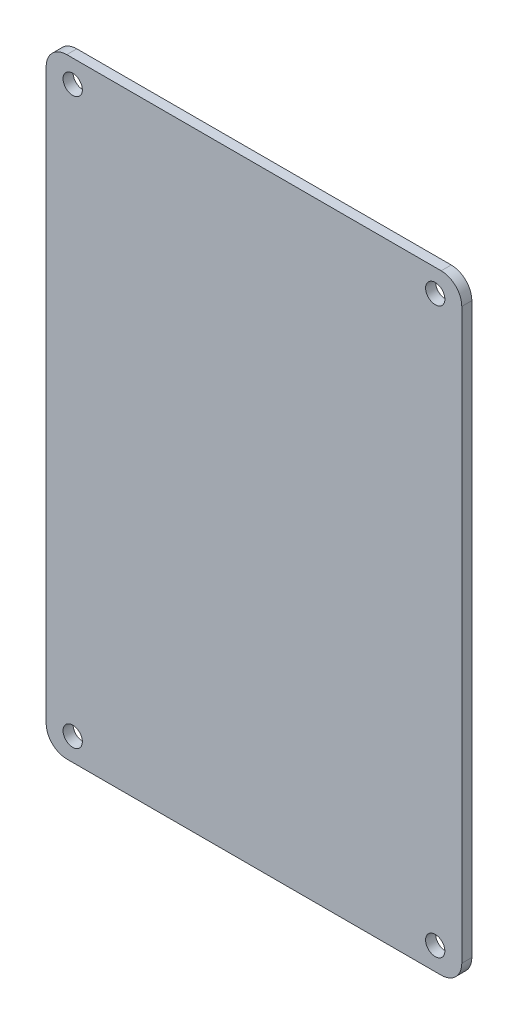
ISO-10303-21;
HEADER;
FILE_DESCRIPTION(('STEP AP214'),'2;1');
FILE_NAME('part.step','',(''),(''),'','','');
FILE_SCHEMA(('AUTOMOTIVE_DESIGN { 1 0 10303 214 1 1 1 1 }'));
ENDSEC;
DATA;
#1=APPLICATION_CONTEXT('core data for automotive mechanical design processes');
#2=APPLICATION_PROTOCOL_DEFINITION('international standard','automotive_design',2000,#1);
#3=PRODUCT_CONTEXT('',#1,'mechanical');
#4=PRODUCT('Part','Part','',(#3));
#5=PRODUCT_RELATED_PRODUCT_CATEGORY('part','',(#4));
#6=PRODUCT_DEFINITION_FORMATION('','',#4);
#7=PRODUCT_DEFINITION_CONTEXT('part definition',#1,'design');
#8=PRODUCT_DEFINITION('design','',#6,#7);
#9=PRODUCT_DEFINITION_SHAPE('','',#8);
#10=(LENGTH_UNIT() NAMED_UNIT(*) SI_UNIT(.MILLI.,.METRE.));
#11=(NAMED_UNIT(*) PLANE_ANGLE_UNIT() SI_UNIT($,.RADIAN.));
#12=(NAMED_UNIT(*) SI_UNIT($,.STERADIAN.) SOLID_ANGLE_UNIT());
#13=UNCERTAINTY_MEASURE_WITH_UNIT(LENGTH_MEASURE(1.E-05),#10,'distance_accuracy_value','');
#14=(GEOMETRIC_REPRESENTATION_CONTEXT(3) GLOBAL_UNCERTAINTY_ASSIGNED_CONTEXT((#13)) GLOBAL_UNIT_ASSIGNED_CONTEXT((#10,
#11,#12)) REPRESENTATION_CONTEXT('',''));
#15=CARTESIAN_POINT('',(0.,0.,0.));
#16=DIRECTION('',(0.,0.,1.));
#17=DIRECTION('',(1.,0.,0.));
#18=AXIS2_PLACEMENT_3D('',#15,#16,#17);
#19=CARTESIAN_POINT('',(0.,0.,0.7747));
#20=DIRECTION('',(0.,0.,-1.));
#21=DIRECTION('',(-1.,0.,0.));
#22=AXIS2_PLACEMENT_3D('',#19,#20,#21);
#23=PLANE('',#22);
#24=DIRECTION('',(0.,-1.,0.));
#25=VECTOR('',#24,1.);
#26=CARTESIAN_POINT('',(-32.0294,-47.0154,0.7747));
#27=LINE('',#26,#25);
#28=CARTESIAN_POINT('',(-32.0294,43.8404,0.7747));
#29=VERTEX_POINT('',#28);
#30=CARTESIAN_POINT('',(-32.0294,-43.8404,0.7747));
#31=VERTEX_POINT('',#30);
#32=EDGE_CURVE('E179',#29,#31,#27,.T.);
#33=ORIENTED_EDGE('',*,*,#32,.T.);
#34=CARTESIAN_POINT('',(-28.8544,-43.8404,0.7747));
#35=DIRECTION('',(0.,0.,-1.));
#36=DIRECTION('',(-1.,0.,0.));
#37=AXIS2_PLACEMENT_3D('',#34,#35,#36);
#38=CIRCLE('',#37,3.175);
#39=CARTESIAN_POINT('',(-28.8544,-47.0154,0.7747));
#40=VERTEX_POINT('',#39);
#41=EDGE_CURVE('E156',#31,#40,#38,.F.);
#42=ORIENTED_EDGE('',*,*,#41,.T.);
#43=DIRECTION('',(1.,0.,0.));
#44=VECTOR('',#43,1.);
#45=CARTESIAN_POINT('',(-32.0294,-47.0154,0.7747));
#46=LINE('',#45,#44);
#47=CARTESIAN_POINT('',(28.8544,-47.0154,0.7747));
#48=VERTEX_POINT('',#47);
#49=EDGE_CURVE('E127',#40,#48,#46,.T.);
#50=ORIENTED_EDGE('',*,*,#49,.T.);
#51=CARTESIAN_POINT('',(28.8544,-43.8404,0.7747));
#52=DIRECTION('',(0.,0.,-1.));
#53=DIRECTION('',(-1.,0.,0.));
#54=AXIS2_PLACEMENT_3D('',#51,#52,#53);
#55=CIRCLE('',#54,3.175);
#56=CARTESIAN_POINT('',(32.0294,-43.8404,0.7747));
#57=VERTEX_POINT('',#56);
#58=EDGE_CURVE('E154',#48,#57,#55,.F.);
#59=ORIENTED_EDGE('',*,*,#58,.T.);
#60=DIRECTION('',(0.,1.,0.));
#61=VECTOR('',#60,1.);
#62=CARTESIAN_POINT('',(32.0294,-47.0154,0.7747));
#63=LINE('',#62,#61);
#64=CARTESIAN_POINT('',(32.0294,43.8404,0.7747));
#65=VERTEX_POINT('',#64);
#66=EDGE_CURVE('E134',#57,#65,#63,.T.);
#67=ORIENTED_EDGE('',*,*,#66,.T.);
#68=CARTESIAN_POINT('',(28.8544,43.8404,0.7747));
#69=DIRECTION('',(0.,0.,-1.));
#70=DIRECTION('',(-1.,0.,0.));
#71=AXIS2_PLACEMENT_3D('',#68,#69,#70);
#72=CIRCLE('',#71,3.175);
#73=CARTESIAN_POINT('',(28.8544,47.0154,0.7747));
#74=VERTEX_POINT('',#73);
#75=EDGE_CURVE('E62',#65,#74,#72,.F.);
#76=ORIENTED_EDGE('',*,*,#75,.T.);
#77=DIRECTION('',(-1.,0.,0.));
#78=VECTOR('',#77,1.);
#79=CARTESIAN_POINT('',(-32.0294,47.0154,0.7747));
#80=LINE('',#79,#78);
#81=CARTESIAN_POINT('',(-28.8544,47.0154,0.7747));
#82=VERTEX_POINT('',#81);
#83=EDGE_CURVE('E137',#74,#82,#80,.T.);
#84=ORIENTED_EDGE('',*,*,#83,.T.);
#85=CARTESIAN_POINT('',(-28.8544,43.8404,0.7747));
#86=DIRECTION('',(0.,0.,-1.));
#87=DIRECTION('',(-1.,0.,0.));
#88=AXIS2_PLACEMENT_3D('',#85,#86,#87);
#89=CIRCLE('',#88,3.175);
#90=EDGE_CURVE('E151',#82,#29,#89,.F.);
#91=ORIENTED_EDGE('',*,*,#90,.T.);
#92=EDGE_LOOP('',(#33,#42,#50,#59,#67,#76,#84,#91));
#93=FACE_BOUND('',#92,.T.);
#94=CARTESIAN_POINT('',(27.94,43.5102,0.7747));
#95=DIRECTION('',(0.,0.,1.));
#96=DIRECTION('',(1.,0.,0.));
#97=AXIS2_PLACEMENT_3D('',#94,#95,#96);
#98=CIRCLE('',#97,1.4859);
#99=CARTESIAN_POINT('',(29.4259,43.5102,0.7747));
#100=VERTEX_POINT('',#99);
#101=EDGE_CURVE('E172',#100,#100,#98,.T.);
#102=ORIENTED_EDGE('',*,*,#101,.F.);
#103=EDGE_LOOP('',(#102));
#104=FACE_BOUND('',#103,.T.);
#105=CARTESIAN_POINT('',(-27.94,43.5102,0.7747));
#106=DIRECTION('',(0.,0.,1.));
#107=DIRECTION('',(1.,0.,0.));
#108=AXIS2_PLACEMENT_3D('',#105,#106,#107);
#109=CIRCLE('',#108,1.4859);
#110=CARTESIAN_POINT('',(-26.4541,43.5102,0.7747));
#111=VERTEX_POINT('',#110);
#112=EDGE_CURVE('E184',#111,#111,#109,.T.);
#113=ORIENTED_EDGE('',*,*,#112,.F.);
#114=EDGE_LOOP('',(#113));
#115=FACE_BOUND('',#114,.T.);
#116=CARTESIAN_POINT('',(-27.94,-43.5102,0.7747));
#117=DIRECTION('',(0.,0.,1.));
#118=DIRECTION('',(1.,0.,0.));
#119=AXIS2_PLACEMENT_3D('',#116,#117,#118);
#120=CIRCLE('',#119,1.4859);
#121=CARTESIAN_POINT('',(-26.4541,-43.5102,0.7747));
#122=VERTEX_POINT('',#121);
#123=EDGE_CURVE('E189',#122,#122,#120,.T.);
#124=ORIENTED_EDGE('',*,*,#123,.F.);
#125=EDGE_LOOP('',(#124));
#126=FACE_BOUND('',#125,.T.);
#127=CARTESIAN_POINT('',(27.94,-43.5102,0.7747));
#128=DIRECTION('',(0.,0.,1.));
#129=DIRECTION('',(1.,0.,0.));
#130=AXIS2_PLACEMENT_3D('',#127,#128,#129);
#131=CIRCLE('',#130,1.4859);
#132=CARTESIAN_POINT('',(29.4259,-43.5102,0.7747));
#133=VERTEX_POINT('',#132);
#134=EDGE_CURVE('E195',#133,#133,#131,.T.);
#135=ORIENTED_EDGE('',*,*,#134,.F.);
#136=EDGE_LOOP('',(#135));
#137=FACE_BOUND('',#136,.T.);
#138=ADVANCED_FACE('F41',(#93,#104,#115,#126,#137),#23,.F.);
#139=CARTESIAN_POINT('',(0.,0.,-0.7747));
#140=DIRECTION('',(0.,0.,-1.));
#141=DIRECTION('',(-1.,0.,0.));
#142=AXIS2_PLACEMENT_3D('',#139,#140,#141);
#143=PLANE('',#142);
#144=CARTESIAN_POINT('',(-27.94,-43.5102,-0.7747));
#145=DIRECTION('',(0.,0.,1.));
#146=DIRECTION('',(1.,0.,0.));
#147=AXIS2_PLACEMENT_3D('',#144,#145,#146);
#148=CIRCLE('',#147,1.4859);
#149=CARTESIAN_POINT('',(-26.4541,-43.5102,-0.7747));
#150=VERTEX_POINT('',#149);
#151=EDGE_CURVE('E192',#150,#150,#148,.T.);
#152=ORIENTED_EDGE('',*,*,#151,.T.);
#153=EDGE_LOOP('',(#152));
#154=FACE_BOUND('',#153,.T.);
#155=CARTESIAN_POINT('',(27.94,43.5102,-0.7747));
#156=DIRECTION('',(0.,0.,1.));
#157=DIRECTION('',(1.,0.,0.));
#158=AXIS2_PLACEMENT_3D('',#155,#156,#157);
#159=CIRCLE('',#158,1.4859);
#160=CARTESIAN_POINT('',(29.4259,43.5102,-0.7747));
#161=VERTEX_POINT('',#160);
#162=EDGE_CURVE('E175',#161,#161,#159,.T.);
#163=ORIENTED_EDGE('',*,*,#162,.T.);
#164=EDGE_LOOP('',(#163));
#165=FACE_BOUND('',#164,.T.);
#166=DIRECTION('',(1.,0.,0.));
#167=VECTOR('',#166,1.);
#168=CARTESIAN_POINT('',(-32.0294,-47.0154,-0.7747));
#169=LINE('',#168,#167);
#170=CARTESIAN_POINT('',(-28.8544,-47.0154,-0.7747));
#171=VERTEX_POINT('',#170);
#172=CARTESIAN_POINT('',(28.8544,-47.0154,-0.7747));
#173=VERTEX_POINT('',#172);
#174=EDGE_CURVE('E124',#171,#173,#169,.T.);
#175=ORIENTED_EDGE('',*,*,#174,.F.);
#176=CARTESIAN_POINT('',(-28.8544,-43.8404,-0.7747));
#177=DIRECTION('',(0.,0.,-1.));
#178=DIRECTION('',(-1.,0.,0.));
#179=AXIS2_PLACEMENT_3D('',#176,#177,#178);
#180=CIRCLE('',#179,3.175);
#181=CARTESIAN_POINT('',(-32.0294,-43.8404,-0.7747));
#182=VERTEX_POINT('',#181);
#183=EDGE_CURVE('E107',#171,#182,#180,.T.);
#184=ORIENTED_EDGE('',*,*,#183,.T.);
#185=DIRECTION('',(0.,-1.,0.));
#186=VECTOR('',#185,1.);
#187=CARTESIAN_POINT('',(-32.0294,-47.0154,-0.7747));
#188=LINE('',#187,#186);
#189=CARTESIAN_POINT('',(-32.0294,43.8404,-0.7747));
#190=VERTEX_POINT('',#189);
#191=EDGE_CURVE('E135',#190,#182,#188,.T.);
#192=ORIENTED_EDGE('',*,*,#191,.F.);
#193=CARTESIAN_POINT('',(-28.8544,43.8404,-0.7747));
#194=DIRECTION('',(0.,0.,-1.));
#195=DIRECTION('',(-1.,0.,0.));
#196=AXIS2_PLACEMENT_3D('',#193,#194,#195);
#197=CIRCLE('',#196,3.175);
#198=CARTESIAN_POINT('',(-28.8544,47.0154,-0.7747));
#199=VERTEX_POINT('',#198);
#200=EDGE_CURVE('E128',#190,#199,#197,.T.);
#201=ORIENTED_EDGE('',*,*,#200,.T.);
#202=DIRECTION('',(-1.,0.,0.));
#203=VECTOR('',#202,1.);
#204=CARTESIAN_POINT('',(-32.0294,47.0154,-0.7747));
#205=LINE('',#204,#203);
#206=CARTESIAN_POINT('',(28.8544,47.0154,-0.7747));
#207=VERTEX_POINT('',#206);
#208=EDGE_CURVE('E139',#207,#199,#205,.T.);
#209=ORIENTED_EDGE('',*,*,#208,.F.);
#210=CARTESIAN_POINT('',(28.8544,43.8404,-0.7747));
#211=DIRECTION('',(0.,0.,-1.));
#212=DIRECTION('',(-1.,0.,0.));
#213=AXIS2_PLACEMENT_3D('',#210,#211,#212);
#214=CIRCLE('',#213,3.175);
#215=CARTESIAN_POINT('',(32.0294,43.8404,-0.7747));
#216=VERTEX_POINT('',#215);
#217=EDGE_CURVE('E145',#207,#216,#214,.T.);
#218=ORIENTED_EDGE('',*,*,#217,.T.);
#219=DIRECTION('',(0.,1.,0.));
#220=VECTOR('',#219,1.);
#221=CARTESIAN_POINT('',(32.0294,-47.0154,-0.7747));
#222=LINE('',#221,#220);
#223=CARTESIAN_POINT('',(32.0294,-43.8404,-0.7747));
#224=VERTEX_POINT('',#223);
#225=EDGE_CURVE('E167',#224,#216,#222,.T.);
#226=ORIENTED_EDGE('',*,*,#225,.F.);
#227=CARTESIAN_POINT('',(28.8544,-43.8404,-0.7747));
#228=DIRECTION('',(0.,0.,-1.));
#229=DIRECTION('',(-1.,0.,0.));
#230=AXIS2_PLACEMENT_3D('',#227,#228,#229);
#231=CIRCLE('',#230,3.175);
#232=EDGE_CURVE('E118',#224,#173,#231,.T.);
#233=ORIENTED_EDGE('',*,*,#232,.T.);
#234=EDGE_LOOP('',(#175,#184,#192,#201,#209,#218,#226,#233));
#235=FACE_BOUND('',#234,.T.);
#236=CARTESIAN_POINT('',(-27.94,43.5102,-0.7747));
#237=DIRECTION('',(0.,0.,1.));
#238=DIRECTION('',(1.,0.,0.));
#239=AXIS2_PLACEMENT_3D('',#236,#237,#238);
#240=CIRCLE('',#239,1.4859);
#241=CARTESIAN_POINT('',(-26.4541,43.5102,-0.7747));
#242=VERTEX_POINT('',#241);
#243=EDGE_CURVE('E186',#242,#242,#240,.T.);
#244=ORIENTED_EDGE('',*,*,#243,.T.);
#245=EDGE_LOOP('',(#244));
#246=FACE_BOUND('',#245,.T.);
#247=CARTESIAN_POINT('',(27.94,-43.5102,-0.7747));
#248=DIRECTION('',(0.,0.,1.));
#249=DIRECTION('',(1.,0.,0.));
#250=AXIS2_PLACEMENT_3D('',#247,#248,#249);
#251=CIRCLE('',#250,1.4859);
#252=CARTESIAN_POINT('',(29.4259,-43.5102,-0.7747));
#253=VERTEX_POINT('',#252);
#254=EDGE_CURVE('E198',#253,#253,#251,.T.);
#255=ORIENTED_EDGE('',*,*,#254,.T.);
#256=EDGE_LOOP('',(#255));
#257=FACE_BOUND('',#256,.T.);
#258=ADVANCED_FACE('F131',(#154,#165,#235,#246,#257),#143,.T.);
#259=CARTESIAN_POINT('',(32.0294,-47.0154,0.7747));
#260=DIRECTION('',(-1.,0.,0.));
#261=DIRECTION('',(0.,0.,1.));
#262=AXIS2_PLACEMENT_3D('',#259,#260,#261);
#263=PLANE('',#262);
#264=ORIENTED_EDGE('',*,*,#66,.F.);
#265=DIRECTION('',(0.,0.,-1.));
#266=VECTOR('',#265,1.);
#267=CARTESIAN_POINT('',(32.0294,-43.8404,0.7747));
#268=LINE('',#267,#266);
#269=EDGE_CURVE('E160',#57,#224,#268,.T.);
#270=ORIENTED_EDGE('',*,*,#269,.T.);
#271=ORIENTED_EDGE('',*,*,#225,.T.);
#272=DIRECTION('',(0.,0.,-1.));
#273=VECTOR('',#272,1.);
#274=CARTESIAN_POINT('',(32.0294,43.8404,0.7747));
#275=LINE('',#274,#273);
#276=EDGE_CURVE('E158',#216,#65,#275,.F.);
#277=ORIENTED_EDGE('',*,*,#276,.T.);
#278=EDGE_LOOP('',(#264,#270,#271,#277));
#279=FACE_BOUND('',#278,.T.);
#280=ADVANCED_FACE('F166',(#279),#263,.F.);
#281=CARTESIAN_POINT('',(-32.0294,47.0154,0.7747));
#282=DIRECTION('',(0.,-1.,0.));
#283=DIRECTION('',(0.,0.,-1.));
#284=AXIS2_PLACEMENT_3D('',#281,#282,#283);
#285=PLANE('',#284);
#286=ORIENTED_EDGE('',*,*,#83,.F.);
#287=DIRECTION('',(0.,0.,-1.));
#288=VECTOR('',#287,1.);
#289=CARTESIAN_POINT('',(28.8544,47.0154,0.7747));
#290=LINE('',#289,#288);
#291=EDGE_CURVE('E11',#74,#207,#290,.T.);
#292=ORIENTED_EDGE('',*,*,#291,.T.);
#293=ORIENTED_EDGE('',*,*,#208,.T.);
#294=DIRECTION('',(0.,0.,-1.));
#295=VECTOR('',#294,1.);
#296=CARTESIAN_POINT('',(-28.8544,47.0154,0.7747));
#297=LINE('',#296,#295);
#298=EDGE_CURVE('E49',#199,#82,#297,.F.);
#299=ORIENTED_EDGE('',*,*,#298,.T.);
#300=EDGE_LOOP('',(#286,#292,#293,#299));
#301=FACE_BOUND('',#300,.T.);
#302=ADVANCED_FACE('F224',(#301),#285,.F.);
#303=CARTESIAN_POINT('',(-32.0294,-47.0154,0.7747));
#304=DIRECTION('',(1.,0.,0.));
#305=DIRECTION('',(0.,0.,-1.));
#306=AXIS2_PLACEMENT_3D('',#303,#304,#305);
#307=PLANE('',#306);
#308=ORIENTED_EDGE('',*,*,#191,.T.);
#309=DIRECTION('',(0.,0.,-1.));
#310=VECTOR('',#309,1.);
#311=CARTESIAN_POINT('',(-32.0294,-43.8404,0.7747));
#312=LINE('',#311,#310);
#313=EDGE_CURVE('E112',#182,#31,#312,.F.);
#314=ORIENTED_EDGE('',*,*,#313,.T.);
#315=ORIENTED_EDGE('',*,*,#32,.F.);
#316=DIRECTION('',(0.,0.,-1.));
#317=VECTOR('',#316,1.);
#318=CARTESIAN_POINT('',(-32.0294,43.8404,0.7747));
#319=LINE('',#318,#317);
#320=EDGE_CURVE('E117',#29,#190,#319,.T.);
#321=ORIENTED_EDGE('',*,*,#320,.T.);
#322=EDGE_LOOP('',(#308,#314,#315,#321));
#323=FACE_BOUND('',#322,.T.);
#324=ADVANCED_FACE('F221',(#323),#307,.F.);
#325=CARTESIAN_POINT('',(-32.0294,-47.0154,0.7747));
#326=DIRECTION('',(0.,1.,0.));
#327=DIRECTION('',(0.,0.,1.));
#328=AXIS2_PLACEMENT_3D('',#325,#326,#327);
#329=PLANE('',#328);
#330=ORIENTED_EDGE('',*,*,#49,.F.);
#331=DIRECTION('',(0.,0.,-1.));
#332=VECTOR('',#331,1.);
#333=CARTESIAN_POINT('',(-28.8544,-47.0154,0.7747));
#334=LINE('',#333,#332);
#335=EDGE_CURVE('E111',#40,#171,#334,.T.);
#336=ORIENTED_EDGE('',*,*,#335,.T.);
#337=ORIENTED_EDGE('',*,*,#174,.T.);
#338=DIRECTION('',(0.,0.,-1.));
#339=VECTOR('',#338,1.);
#340=CARTESIAN_POINT('',(28.8544,-47.0154,0.7747));
#341=LINE('',#340,#339);
#342=EDGE_CURVE('E129',#173,#48,#341,.F.);
#343=ORIENTED_EDGE('',*,*,#342,.T.);
#344=EDGE_LOOP('',(#330,#336,#337,#343));
#345=FACE_BOUND('',#344,.T.);
#346=ADVANCED_FACE('F123',(#345),#329,.F.);
#347=CARTESIAN_POINT('',(27.94,43.5102,0.7747));
#348=DIRECTION('',(0.,0.,-1.));
#349=DIRECTION('',(-1.,0.,0.));
#350=AXIS2_PLACEMENT_3D('',#347,#348,#349);
#351=CYLINDRICAL_SURFACE('',#350,1.4859);
#352=ORIENTED_EDGE('',*,*,#101,.T.);
#353=EDGE_LOOP('',(#352));
#354=FACE_BOUND('',#353,.T.);
#355=ORIENTED_EDGE('',*,*,#162,.F.);
#356=EDGE_LOOP('',(#355));
#357=FACE_BOUND('',#356,.T.);
#358=ADVANCED_FACE('F216',(#354,#357),#351,.F.);
#359=CARTESIAN_POINT('',(-27.94,43.5102,0.7747));
#360=DIRECTION('',(0.,0.,-1.));
#361=DIRECTION('',(-1.,0.,0.));
#362=AXIS2_PLACEMENT_3D('',#359,#360,#361);
#363=CYLINDRICAL_SURFACE('',#362,1.4859);
#364=ORIENTED_EDGE('',*,*,#112,.T.);
#365=EDGE_LOOP('',(#364));
#366=FACE_BOUND('',#365,.T.);
#367=ORIENTED_EDGE('',*,*,#243,.F.);
#368=EDGE_LOOP('',(#367));
#369=FACE_BOUND('',#368,.T.);
#370=ADVANCED_FACE('F317',(#366,#369),#363,.F.);
#371=CARTESIAN_POINT('',(-27.94,-43.5102,0.7747));
#372=DIRECTION('',(0.,0.,-1.));
#373=DIRECTION('',(-1.,0.,0.));
#374=AXIS2_PLACEMENT_3D('',#371,#372,#373);
#375=CYLINDRICAL_SURFACE('',#374,1.4859);
#376=ORIENTED_EDGE('',*,*,#123,.T.);
#377=EDGE_LOOP('',(#376));
#378=FACE_BOUND('',#377,.T.);
#379=ORIENTED_EDGE('',*,*,#151,.F.);
#380=EDGE_LOOP('',(#379));
#381=FACE_BOUND('',#380,.T.);
#382=ADVANCED_FACE('F308',(#378,#381),#375,.F.);
#383=CARTESIAN_POINT('',(27.94,-43.5102,0.7747));
#384=DIRECTION('',(0.,0.,-1.));
#385=DIRECTION('',(-1.,0.,0.));
#386=AXIS2_PLACEMENT_3D('',#383,#384,#385);
#387=CYLINDRICAL_SURFACE('',#386,1.4859);
#388=ORIENTED_EDGE('',*,*,#134,.T.);
#389=EDGE_LOOP('',(#388));
#390=FACE_BOUND('',#389,.T.);
#391=ORIENTED_EDGE('',*,*,#254,.F.);
#392=EDGE_LOOP('',(#391));
#393=FACE_BOUND('',#392,.T.);
#394=ADVANCED_FACE('F204',(#390,#393),#387,.F.);
#395=CARTESIAN_POINT('',(-28.8544,-43.8404,0.7747));
#396=DIRECTION('',(0.,0.,-1.));
#397=DIRECTION('',(-1.,0.,0.));
#398=AXIS2_PLACEMENT_3D('',#395,#396,#397);
#399=CYLINDRICAL_SURFACE('',#398,3.175);
#400=ORIENTED_EDGE('',*,*,#41,.F.);
#401=ORIENTED_EDGE('',*,*,#313,.F.);
#402=ORIENTED_EDGE('',*,*,#183,.F.);
#403=ORIENTED_EDGE('',*,*,#335,.F.);
#404=EDGE_LOOP('',(#400,#401,#402,#403));
#405=FACE_BOUND('',#404,.T.);
#406=ADVANCED_FACE('F110',(#405),#399,.T.);
#407=CARTESIAN_POINT('',(28.8544,-43.8404,0.7747));
#408=DIRECTION('',(0.,0.,-1.));
#409=DIRECTION('',(-1.,0.,0.));
#410=AXIS2_PLACEMENT_3D('',#407,#408,#409);
#411=CYLINDRICAL_SURFACE('',#410,3.175);
#412=ORIENTED_EDGE('',*,*,#58,.F.);
#413=ORIENTED_EDGE('',*,*,#342,.F.);
#414=ORIENTED_EDGE('',*,*,#232,.F.);
#415=ORIENTED_EDGE('',*,*,#269,.F.);
#416=EDGE_LOOP('',(#412,#413,#414,#415));
#417=FACE_BOUND('',#416,.T.);
#418=ADVANCED_FACE('F232',(#417),#411,.T.);
#419=CARTESIAN_POINT('',(28.8544,43.8404,0.7747));
#420=DIRECTION('',(0.,0.,-1.));
#421=DIRECTION('',(-1.,0.,0.));
#422=AXIS2_PLACEMENT_3D('',#419,#420,#421);
#423=CYLINDRICAL_SURFACE('',#422,3.175);
#424=ORIENTED_EDGE('',*,*,#75,.F.);
#425=ORIENTED_EDGE('',*,*,#276,.F.);
#426=ORIENTED_EDGE('',*,*,#217,.F.);
#427=ORIENTED_EDGE('',*,*,#291,.F.);
#428=EDGE_LOOP('',(#424,#425,#426,#427));
#429=FACE_BOUND('',#428,.T.);
#430=ADVANCED_FACE('F234',(#429),#423,.T.);
#431=CARTESIAN_POINT('',(-28.8544,43.8404,0.7747));
#432=DIRECTION('',(0.,0.,-1.));
#433=DIRECTION('',(-1.,0.,0.));
#434=AXIS2_PLACEMENT_3D('',#431,#432,#433);
#435=CYLINDRICAL_SURFACE('',#434,3.175);
#436=ORIENTED_EDGE('',*,*,#90,.F.);
#437=ORIENTED_EDGE('',*,*,#298,.F.);
#438=ORIENTED_EDGE('',*,*,#200,.F.);
#439=ORIENTED_EDGE('',*,*,#320,.F.);
#440=EDGE_LOOP('',(#436,#437,#438,#439));
#441=FACE_BOUND('',#440,.T.);
#442=ADVANCED_FACE('F43',(#441),#435,.T.);
#443=CLOSED_SHELL('',(#138,#258,#280,#302,#324,#346,#358,#370,#382,#394,#406,#418,#430,#442));
#444=MANIFOLD_SOLID_BREP('B2',#443);
#445=ADVANCED_BREP_SHAPE_REPRESENTATION('',(#18,#444),#14);
#446=SHAPE_DEFINITION_REPRESENTATION(#9,#445);
ENDSEC;
END-ISO-10303-21;
